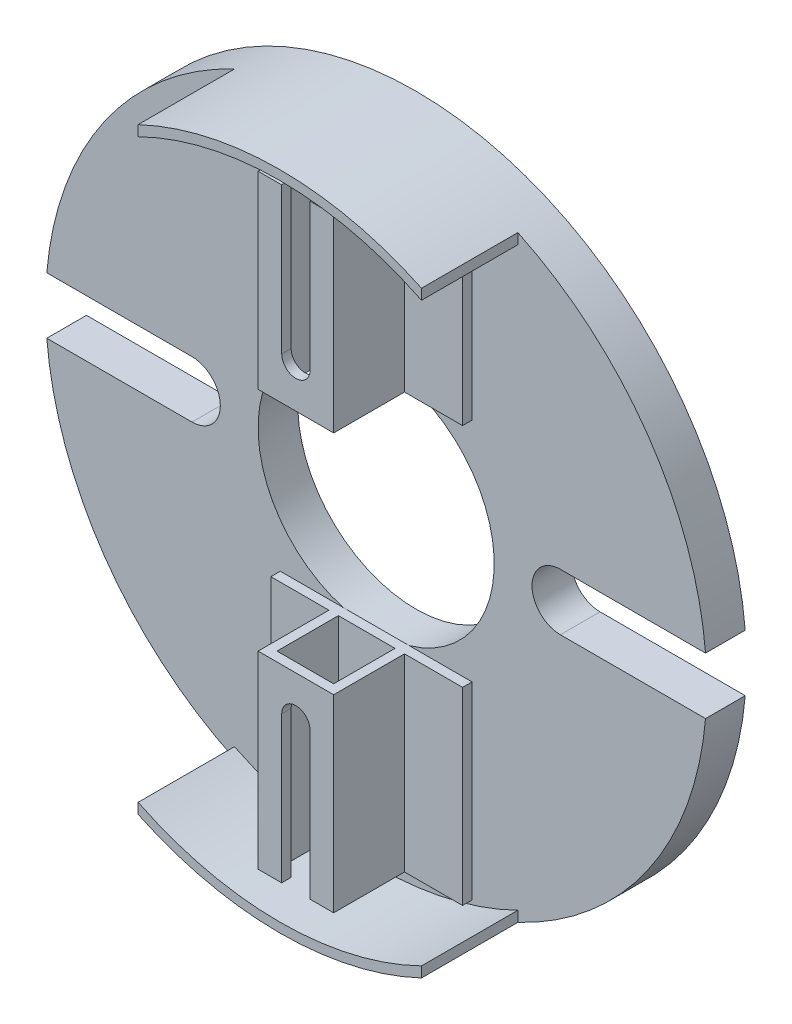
from build123d import *

# Parameters (mm, degrees)
ESQUISSE1_R                  = 12.5
EXTRUSION1_DEPTH             = 4.2
EXTRUSION2_DEPTH             = 10.2
ESQUISSE3_W                  = 6
ESQUISSE3_H                  = 6.5
EXTRUSION3_DEPTH             = 20
ENL_V_MAT_EXTRU_1_REACH      = 82.203
R_P_TITION_CIRCULAIRE1_COUNT = 2


with BuildPart() as part:
    # Esquisse1 → Extrusion1 (new body)
    with BuildSketch(Plane.XY):
        with BuildLine():
            Line((19.5, -33.1), (34.871191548, -33.1))
            ThreePointArc((34.871191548, -33.1), (0, -1.1), (-34.871191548, -33.1))
            Line((-34.871191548, -33.1), (-19.5, -33.1))
            ThreePointArc((-19.5, -33.1), (-16.5, -36.1), (-19.5, -39.1))
            Line((-19.5, -39.1), (-34.871191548, -39.1))
            ThreePointArc((-34.871191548, -39.1), (0, -71.1), (34.871191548, -39.1))
            Line((34.871191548, -39.1), (19.5, -39.1))
            ThreePointArc((19.5, -39.1), (16.5, -36.1), (19.5, -33.1))
        make_face()
        with Locations((0, -36.1)):
            Circle(ESQUISSE1_R, mode=Mode.SUBTRACT)
    extrude(amount=EXTRUSION1_DEPTH)

    # Esquisse2 → Extrusion2 (add)
    with BuildSketch(Plane.XY.offset(4.2)):
        with BuildLine():
            Line((-15, -4.477223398), (-15, -5.587707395))
            ThreePointArc((-15, -5.587707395), (0, -2.1), (15, -5.587707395))
            Line((15, -5.587707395), (15, -4.477223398))
            ThreePointArc((15, -4.477223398), (0, -1.1), (-15, -4.477223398))
        make_face()
    extrusion2 = extrude(amount=EXTRUSION2_DEPTH)

    # Esquisse3 → Extrusion3 (add)
    with BuildSketch(Plane(origin=(0, -24.1, 0), x_dir=(-1, 0, 0), z_dir=(0, 1, 0))):
        Polygon((3, 4.2), (10.15, 4.2), (10.15, 5.2), (4, 5.2), (4, 12.7), (-4, 12.7), (-4, 5.2), (-10.15, 5.2), (-10.15, 4.2), align=None)
        with Locations((0, 8.45)):
            Rectangle(ESQUISSE3_W, ESQUISSE3_H, mode=Mode.SUBTRACT)
    extrusion3 = extrude(amount=EXTRUSION3_DEPTH)

    # Esquisse4 → Enl_v. mat.-Extru.1 (cut, up to next)
    with BuildSketch(Plane.XY.offset(12.7), mode=Mode.PRIVATE) as enl_v_mat_extru_1_sk1:
        with BuildLine():
            Line((-1.5, -4.1), (1.5, -4.1))
            Line((1.5, -4.1), (1.5, -19.6))
            ThreePointArc((1.5, -19.6), (0, -21.1), (-1.5, -19.6))
            Line((-1.5, -19.6), (-1.5, -4.1))
        make_face()
    enl_v_mat_extru_1_tool1 = extrude(enl_v_mat_extru_1_sk1.sketch, amount=-ENL_V_MAT_EXTRU_1_REACH, mode=Mode.PRIVATE) & part.part
    enl_v_mat_extru_1 = enl_v_mat_extru_1_tool1.solids().sort_by_distance((0, -12.442409, 12.7))[0]
    add(enl_v_mat_extru_1, mode=Mode.SUBTRACT)

    # R_p_tition circulaire1: Extrusion2, Extrusion3, Enl_v. mat.-Extru.1 ×2 about axis
    r_p_tition_circulaire1_axis = Axis((0, -36.1, 0), (0, 0, 1))
    add([extrusion2.rotate(r_p_tition_circulaire1_axis, i * 360 / R_P_TITION_CIRCULAIRE1_COUNT) for i in range(1, R_P_TITION_CIRCULAIRE1_COUNT)])
    add([extrusion3.rotate(r_p_tition_circulaire1_axis, i * 360 / R_P_TITION_CIRCULAIRE1_COUNT) for i in range(1, R_P_TITION_CIRCULAIRE1_COUNT)])
    add([enl_v_mat_extru_1.rotate(r_p_tition_circulaire1_axis, i * 360 / R_P_TITION_CIRCULAIRE1_COUNT) for i in range(1, R_P_TITION_CIRCULAIRE1_COUNT)], mode=Mode.SUBTRACT)


solid = part.part
